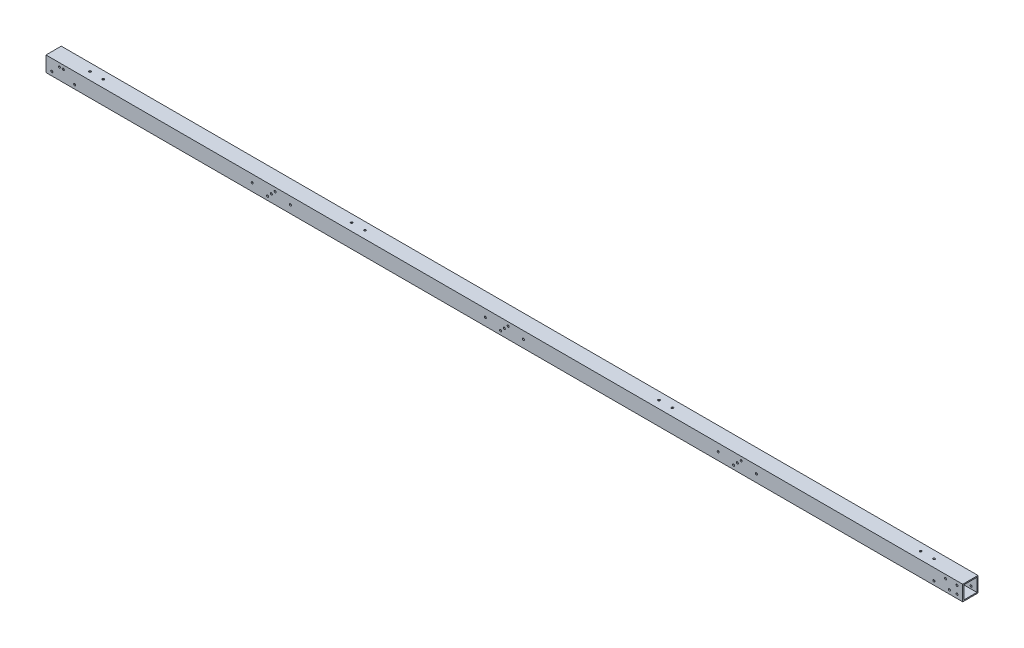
from build123d import *

# Parameters (mm, degrees)
SKETCH1_W          = 50.8
SKETCH1_H          = 50.8
SKETCH1_W_2        = 43.4848
SKETCH1_H_2        = 43.4848
EXTRUDE1_DEPTH     = 3048
SKETCH3_R          = 3.37312
CUT_EXTRUDE2_DEPTH = 3049.846549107
SKETCH4_R          = 3.37312
CUT_EXTRUDE3_DEPTH = 3049.846549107
SKETCH6_R          = 3.37312
CUT_EXTRUDE4_DEPTH = 3049.846549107
SKETCH7_R          = 3.37312
CUT_EXTRUDE5_DEPTH = 3049.846549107
SKETCH8_R          = 3.30403611
SKETCH8_R_2        = 3.190210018
CUT_EXTRUDE6_DEPTH = 3049.846549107
SKETCH9_R          = 3.37312
CUT_EXTRUDE7_DEPTH = 3049.846549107
SKETCH12_R         = 3.37312
CUT_EXTRUDE8_DEPTH = 3049.846549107


with BuildPart() as part:
    # Sketch1 → Extrude1 (new body)
    with BuildSketch(Plane(origin=(0, 0, 0), x_dir=(0, 0, -1), z_dir=(1, 0, 0))):
        with Locations((25.4, 25.4)):
            Rectangle(SKETCH1_W, SKETCH1_H)
        with Locations((25.4, 25.4)):
            Rectangle(SKETCH1_W_2, SKETCH1_H_2, mode=Mode.SUBTRACT)
    extrude(amount=EXTRUDE1_DEPTH)

    # Sketch3 → Cut-Extrude2 (cut, through all)
    with BuildSketch(Plane(origin=(0, 0, -50.8), x_dir=(-1, 0, 0), z_dir=(0, 0, -1))):
        with Locations(Location((-95.618762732, 12.332424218, 0), (0, 0, 270))):
            Circle(SKETCH3_R)
        with Locations((-57.68489445, 37.979873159)):
            Circle(SKETCH3_R)
        with Locations(Location((-3028.95, 12.7, 0), (0, 0, 270))):
            Circle(SKETCH3_R)
        with Locations((-19.420376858, 12.828398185)):
            Circle(SKETCH3_R)
        with Locations((-2952.219610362, 12.332424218)):
            Circle(SKETCH3_R)
        with Locations(Location((-2990.85, 38.1, 0), (0, 0, 270))):
            Circle(SKETCH3_R)
    extrude(amount=-CUT_EXTRUDE2_DEPTH, mode=Mode.SUBTRACT)

    # Sketch4 → Cut-Extrude3 (cut, through all)
    with BuildSketch(Plane(origin=(0, 0, -50.8), x_dir=(-1, 0, 0), z_dir=(0, 0, -1))):
        with Locations((-2235.146563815, 25.4)):
            Circle(SKETCH4_R)
        with Locations((-2298.646563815, 25.4)):
            Circle(SKETCH4_R)
        with Locations((-2362.146563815, 25.4)):
            Circle(SKETCH4_R)
        with Locations((-812.746563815, 25.4)):
            Circle(SKETCH4_R)
        with Locations((-749.246563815, 25.4)):
            Circle(SKETCH4_R)
        with Locations((-685.746563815, 25.4)):
            Circle(SKETCH4_R)
    extrude(amount=-CUT_EXTRUDE3_DEPTH, mode=Mode.SUBTRACT)

    # Sketch6 → Cut-Extrude4 (cut, through all)
    with BuildSketch(Plane(origin=(0, 0, -50.8), x_dir=(-1, 0, 0), z_dir=(0, 0, -1))):
        with Locations((-1524.053436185, 25.4)):
            Circle(SKETCH6_R)
        with Locations((-1460.553436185, 25.4)):
            Circle(SKETCH6_R)
        with Locations((-1587.553436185, 25.4)):
            Circle(SKETCH6_R)
        with Locations((-736.653436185, 12.7)):
            Circle(SKETCH6_R)
        with Locations((-762.053436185, 38.1)):
            Circle(SKETCH6_R)
        with Locations((-2311.453436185, 38.1)):
            Circle(SKETCH6_R)
        with Locations((-2286.053436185, 12.7)):
            Circle(SKETCH6_R)
    extrude(amount=-CUT_EXTRUDE4_DEPTH, mode=Mode.SUBTRACT)

    # Sketch7 → Cut-Extrude5 (cut, through all)
    with BuildSketch(Plane(origin=(0, 0, -50.8), x_dir=(-1, 0, 0), z_dir=(0, 0, -1))):
        with Locations((-1536.7, 38.1)):
            Circle(SKETCH7_R)
        with Locations((-1511.246563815, 12.7)):
            Circle(SKETCH7_R)
    extrude(amount=-CUT_EXTRUDE5_DEPTH, mode=Mode.SUBTRACT)

    # Sketch8 → Cut-Extrude6 (cut, through all)
    with BuildSketch(Plane.XY):
        with Locations((95.25, 12.7)):
            Circle(SKETCH8_R)
        with Locations((57.15, 38.1)):
            Circle(SKETCH8_R_2)
        with Locations((19.05, 12.7)):
            Circle(SKETCH8_R)
        with Locations((3028.95, 12.7)):
            Circle(SKETCH8_R)
        with Locations((2990.85, 38.1)):
            Circle(SKETCH8_R_2)
        with Locations((2952.75, 12.7)):
            Circle(SKETCH8_R)
    extrude(amount=-CUT_EXTRUDE6_DEPTH, mode=Mode.SUBTRACT)

    # Sketch9 → Cut-Extrude7 (cut, through all)
    with BuildSketch(Plane(origin=(0, 0, -50.8), x_dir=(-1, 0, 0), z_dir=(0, 0, -1))):
        with Locations((-44.45, 38.1)):
            Circle(SKETCH9_R)
        with Locations((-3003.55, 12.7)):
            Circle(SKETCH9_R)
        with Locations((-3028.95, 38.1)):
            Circle(SKETCH9_R)
    extrude(amount=-CUT_EXTRUDE7_DEPTH, mode=Mode.SUBTRACT)

    # Sketch12 → Cut-Extrude8 (cut, through all)
    with BuildSketch(Plane.XZ):
        with Locations(Location((165.028278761, -25.4000012, 0), (0, 0, 270))):
            Circle(SKETCH12_R)
        with Locations(Location((120.721722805, -25.4, 0), (0, 0, 270))):
            Circle(SKETCH12_R)
        with Locations(Location((1035.121722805, -25.4, 0), (0, 0, 270))):
            Circle(SKETCH12_R)
        with Locations(Location((990.815166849, -25.4000012, 0), (0, 0, 270))):
            Circle(SKETCH12_R)
        with Locations(Location((2057.256555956, -25.4000012, 0), (0, 0, 270))):
            Circle(SKETCH12_R)
        with Locations(Location((2012.95, -25.4, 0), (0, 0, 270))):
            Circle(SKETCH12_R)
        with Locations(Location((2927.35, -25.4, 0), (0, 0, 270))):
            Circle(SKETCH12_R)
        with Locations(Location((2882.971721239, -25.4000012, 0), (0, 0, 270))):
            Circle(SKETCH12_R)
    extrude(amount=-CUT_EXTRUDE8_DEPTH, mode=Mode.SUBTRACT)


solid = part.part
